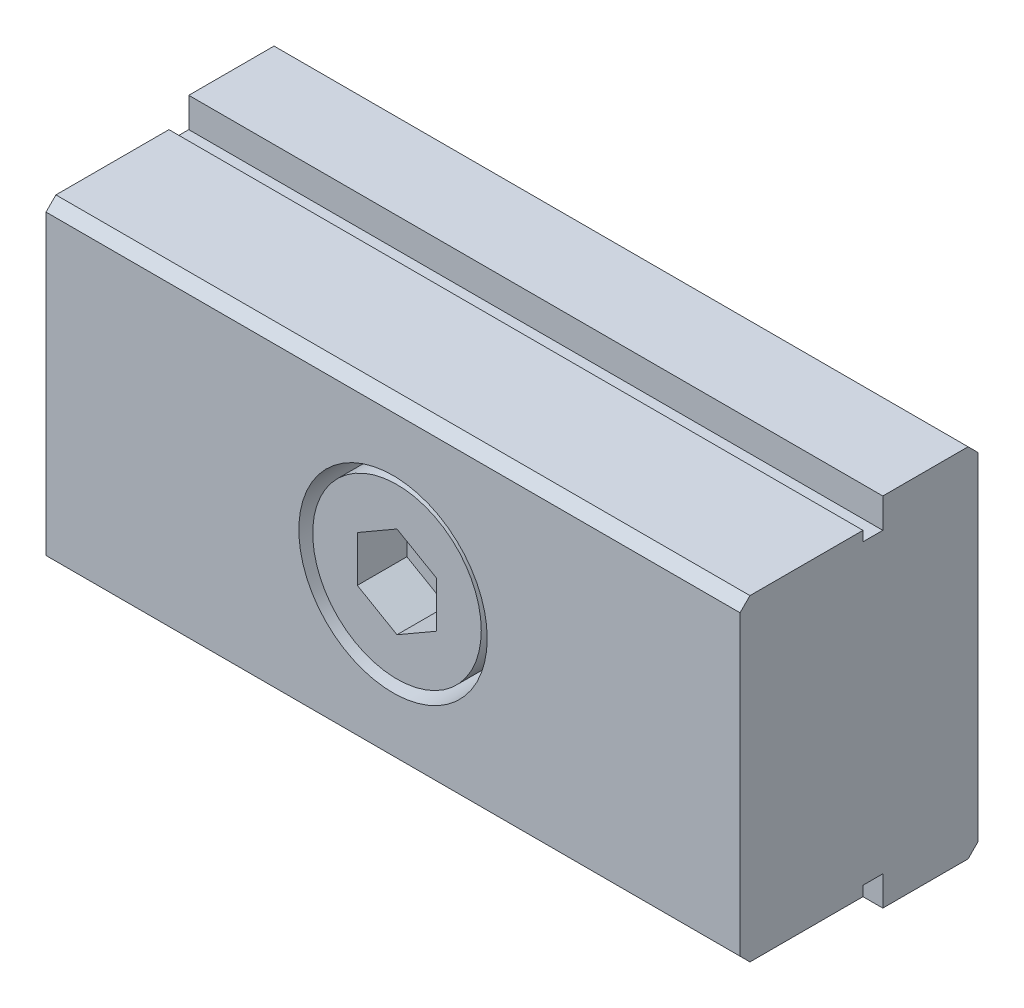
ISO-10303-21;
HEADER;
FILE_DESCRIPTION(('STEP AP214'),'2;1');
FILE_NAME('part.step','',(''),(''),'','','');
FILE_SCHEMA(('AUTOMOTIVE_DESIGN { 1 0 10303 214 1 1 1 1 }'));
ENDSEC;
DATA;
#1=APPLICATION_CONTEXT('core data for automotive mechanical design processes');
#2=APPLICATION_PROTOCOL_DEFINITION('international standard','automotive_design',2000,#1);
#3=PRODUCT_CONTEXT('',#1,'mechanical');
#4=PRODUCT('Part','Part','',(#3));
#5=PRODUCT_RELATED_PRODUCT_CATEGORY('part','',(#4));
#6=PRODUCT_DEFINITION_FORMATION('','',#4);
#7=PRODUCT_DEFINITION_CONTEXT('part definition',#1,'design');
#8=PRODUCT_DEFINITION('design','',#6,#7);
#9=PRODUCT_DEFINITION_SHAPE('','',#8);
#10=(LENGTH_UNIT() NAMED_UNIT(*) SI_UNIT(.MILLI.,.METRE.));
#11=(NAMED_UNIT(*) PLANE_ANGLE_UNIT() SI_UNIT($,.RADIAN.));
#12=(NAMED_UNIT(*) SI_UNIT($,.STERADIAN.) SOLID_ANGLE_UNIT());
#13=UNCERTAINTY_MEASURE_WITH_UNIT(LENGTH_MEASURE(1.E-05),#10,'distance_accuracy_value','');
#14=(GEOMETRIC_REPRESENTATION_CONTEXT(3) GLOBAL_UNCERTAINTY_ASSIGNED_CONTEXT((#13)) GLOBAL_UNIT_ASSIGNED_CONTEXT((#10,
#11,#12)) REPRESENTATION_CONTEXT('',''));
#15=CARTESIAN_POINT('',(0.,0.,0.));
#16=DIRECTION('',(0.,0.,1.));
#17=DIRECTION('',(1.,0.,0.));
#18=AXIS2_PLACEMENT_3D('',#15,#16,#17);
#19=CARTESIAN_POINT('',(2.5,0.,-10.));
#20=DIRECTION('',(0.,0.,-1.));
#21=DIRECTION('',(-1.,0.,0.));
#22=AXIS2_PLACEMENT_3D('',#19,#20,#21);
#23=PLANE('',#22);
#24=CARTESIAN_POINT('',(0.,0.,-10.));
#25=DIRECTION('',(0.,0.,-1.));
#26=DIRECTION('',(-1.,0.,0.));
#27=AXIS2_PLACEMENT_3D('',#24,#25,#26);
#28=CIRCLE('',#27,1.6);
#29=CARTESIAN_POINT('',(-1.6,0.,-10.));
#30=VERTEX_POINT('',#29);
#31=EDGE_CURVE('E24',#30,#30,#28,.T.);
#32=ORIENTED_EDGE('',*,*,#31,.T.);
#33=EDGE_LOOP('',(#32));
#34=FACE_BOUND('',#33,.T.);
#35=ADVANCED_FACE('F14',(#34),#23,.T.);
#36=CARTESIAN_POINT('',(0.,0.,-9.1));
#37=DIRECTION('',(0.,0.,1.));
#38=DIRECTION('',(1.,0.,0.));
#39=AXIS2_PLACEMENT_3D('',#36,#37,#38);
#40=CONICAL_SURFACE('',#39,2.5,0.785398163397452);
#41=ORIENTED_EDGE('',*,*,#31,.F.);
#42=EDGE_LOOP('',(#41));
#43=FACE_BOUND('',#42,.T.);
#44=CARTESIAN_POINT('',(0.,0.,-9.1));
#45=DIRECTION('',(0.,0.,-1.));
#46=DIRECTION('',(-1.,0.,0.));
#47=AXIS2_PLACEMENT_3D('',#44,#45,#46);
#48=CIRCLE('',#47,2.5);
#49=CARTESIAN_POINT('',(-2.5,0.,-9.1));
#50=VERTEX_POINT('',#49);
#51=EDGE_CURVE('E224',#50,#50,#48,.F.);
#52=ORIENTED_EDGE('',*,*,#51,.F.);
#53=EDGE_LOOP('',(#52));
#54=FACE_BOUND('',#53,.T.);
#55=ADVANCED_FACE('F397',(#43,#54),#40,.T.);
#56=CARTESIAN_POINT('',(0.,0.,10.));
#57=DIRECTION('',(0.,0.,1.));
#58=DIRECTION('',(1.,0.,0.));
#59=AXIS2_PLACEMENT_3D('',#56,#57,#58);
#60=CYLINDRICAL_SURFACE('',#59,2.5);
#61=ORIENTED_EDGE('',*,*,#51,.T.);
#62=EDGE_LOOP('',(#61));
#63=FACE_BOUND('',#62,.T.);
#64=CARTESIAN_POINT('',(0.,0.,2.));
#65=DIRECTION('',(0.,0.,1.));
#66=DIRECTION('',(1.,0.,0.));
#67=AXIS2_PLACEMENT_3D('',#64,#65,#66);
#68=CIRCLE('',#67,2.5);
#69=CARTESIAN_POINT('',(2.5,0.,2.));
#70=VERTEX_POINT('',#69);
#71=EDGE_CURVE('E215',#70,#70,#68,.T.);
#72=ORIENTED_EDGE('',*,*,#71,.F.);
#73=EDGE_LOOP('',(#72));
#74=FACE_BOUND('',#73,.T.);
#75=ADVANCED_FACE('F386',(#63,#74),#60,.T.);
#76=CARTESIAN_POINT('',(4.25,0.,2.));
#77=DIRECTION('',(0.,0.,-1.));
#78=DIRECTION('',(-1.,0.,0.));
#79=AXIS2_PLACEMENT_3D('',#76,#77,#78);
#80=PLANE('',#79);
#81=ORIENTED_EDGE('',*,*,#71,.T.);
#82=EDGE_LOOP('',(#81));
#83=FACE_BOUND('',#82,.T.);
#84=CARTESIAN_POINT('',(0.,0.,2.));
#85=DIRECTION('',(0.,0.,-1.));
#86=DIRECTION('',(-1.,0.,0.));
#87=AXIS2_PLACEMENT_3D('',#84,#85,#86);
#88=CIRCLE('',#87,2.75);
#89=CARTESIAN_POINT('',(-2.75,0.,2.));
#90=VERTEX_POINT('',#89);
#91=EDGE_CURVE('E9',#90,#90,#88,.T.);
#92=ORIENTED_EDGE('',*,*,#91,.T.);
#93=EDGE_LOOP('',(#92));
#94=FACE_BOUND('',#93,.T.);
#95=ADVANCED_FACE('F376',(#83,#94),#80,.T.);
#96=CARTESIAN_POINT('',(0.,2.3094010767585,4.5));
#97=DIRECTION('',(-0.5,-0.86602540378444,0.));
#98=DIRECTION('',(0.86602540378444,-0.5,0.));
#99=AXIS2_PLACEMENT_3D('',#96,#97,#98);
#100=PLANE('',#99);
#101=DIRECTION('',(0.,0.,1.));
#102=VECTOR('',#101,1.);
#103=CARTESIAN_POINT('',(2.,1.15470053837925,4.5));
#104=LINE('',#103,#102);
#105=CARTESIAN_POINT('',(2.,1.15470053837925,4.5));
#106=VERTEX_POINT('',#105);
#107=CARTESIAN_POINT('',(2.,1.15470053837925,7.));
#108=VERTEX_POINT('',#107);
#109=EDGE_CURVE('E144',#106,#108,#104,.T.);
#110=ORIENTED_EDGE('',*,*,#109,.T.);
#111=DIRECTION('',(0.86602540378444,-0.5,0.));
#112=VECTOR('',#111,1.);
#113=CARTESIAN_POINT('',(0.,2.3094010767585,7.));
#114=LINE('',#113,#112);
#115=CARTESIAN_POINT('',(0.,2.3094010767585,7.));
#116=VERTEX_POINT('',#115);
#117=EDGE_CURVE('E33',#116,#108,#114,.T.);
#118=ORIENTED_EDGE('',*,*,#117,.F.);
#119=DIRECTION('',(0.,0.,1.));
#120=VECTOR('',#119,1.);
#121=CARTESIAN_POINT('',(0.,2.3094010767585,4.5));
#122=LINE('',#121,#120);
#123=CARTESIAN_POINT('',(0.,2.3094010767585,4.5));
#124=VERTEX_POINT('',#123);
#125=EDGE_CURVE('E183',#124,#116,#122,.T.);
#126=ORIENTED_EDGE('',*,*,#125,.F.);
#127=DIRECTION('',(0.86602540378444,-0.5,0.));
#128=VECTOR('',#127,1.);
#129=CARTESIAN_POINT('',(0.,2.3094010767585,4.5));
#130=LINE('',#129,#128);
#131=EDGE_CURVE('E196',#124,#106,#130,.T.);
#132=ORIENTED_EDGE('',*,*,#131,.T.);
#133=EDGE_LOOP('',(#110,#118,#126,#132));
#134=FACE_BOUND('',#133,.T.);
#135=ADVANCED_FACE('F374',(#134),#100,.T.);
#136=CARTESIAN_POINT('',(2.,-1.15470053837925,4.5));
#137=DIRECTION('',(1.,0.,0.));
#138=DIRECTION('',(0.,0.,-1.));
#139=AXIS2_PLACEMENT_3D('',#136,#137,#138);
#140=PLANE('',#139);
#141=DIRECTION('',(0.,0.,1.));
#142=VECTOR('',#141,1.);
#143=CARTESIAN_POINT('',(2.,-1.15470053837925,4.5));
#144=LINE('',#143,#142);
#145=CARTESIAN_POINT('',(2.,-1.15470053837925,4.5));
#146=VERTEX_POINT('',#145);
#147=CARTESIAN_POINT('',(2.,-1.15470053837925,7.));
#148=VERTEX_POINT('',#147);
#149=EDGE_CURVE('E212',#146,#148,#144,.T.);
#150=ORIENTED_EDGE('',*,*,#149,.T.);
#151=DIRECTION('',(0.,1.,0.));
#152=VECTOR('',#151,1.);
#153=CARTESIAN_POINT('',(2.,-1.15470053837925,7.));
#154=LINE('',#153,#152);
#155=EDGE_CURVE('E351',#148,#108,#154,.T.);
#156=ORIENTED_EDGE('',*,*,#155,.T.);
#157=ORIENTED_EDGE('',*,*,#109,.F.);
#158=DIRECTION('',(0.,1.,0.));
#159=VECTOR('',#158,1.);
#160=CARTESIAN_POINT('',(2.,-1.15470053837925,4.5));
#161=LINE('',#160,#159);
#162=EDGE_CURVE('E206',#146,#106,#161,.T.);
#163=ORIENTED_EDGE('',*,*,#162,.F.);
#164=EDGE_LOOP('',(#150,#156,#157,#163));
#165=FACE_BOUND('',#164,.T.);
#166=ADVANCED_FACE('F373',(#165),#140,.F.);
#167=CARTESIAN_POINT('',(0.,-2.3094010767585,4.5));
#168=DIRECTION('',(0.5,-0.86602540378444,0.));
#169=DIRECTION('',(0.86602540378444,0.5,0.));
#170=AXIS2_PLACEMENT_3D('',#167,#168,#169);
#171=PLANE('',#170);
#172=DIRECTION('',(0.,0.,1.));
#173=VECTOR('',#172,1.);
#174=CARTESIAN_POINT('',(0.,-2.3094010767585,4.5));
#175=LINE('',#174,#173);
#176=CARTESIAN_POINT('',(0.,-2.3094010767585,4.5));
#177=VERTEX_POINT('',#176);
#178=CARTESIAN_POINT('',(0.,-2.3094010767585,7.));
#179=VERTEX_POINT('',#178);
#180=EDGE_CURVE('E210',#177,#179,#175,.T.);
#181=ORIENTED_EDGE('',*,*,#180,.T.);
#182=DIRECTION('',(0.86602540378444,0.5,0.));
#183=VECTOR('',#182,1.);
#184=CARTESIAN_POINT('',(0.,-2.3094010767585,7.));
#185=LINE('',#184,#183);
#186=EDGE_CURVE('E354',#179,#148,#185,.T.);
#187=ORIENTED_EDGE('',*,*,#186,.T.);
#188=ORIENTED_EDGE('',*,*,#149,.F.);
#189=DIRECTION('',(0.86602540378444,0.5,0.));
#190=VECTOR('',#189,1.);
#191=CARTESIAN_POINT('',(0.,-2.3094010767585,4.5));
#192=LINE('',#191,#190);
#193=EDGE_CURVE('E203',#177,#146,#192,.T.);
#194=ORIENTED_EDGE('',*,*,#193,.F.);
#195=EDGE_LOOP('',(#181,#187,#188,#194));
#196=FACE_BOUND('',#195,.T.);
#197=ADVANCED_FACE('F372',(#196),#171,.F.);
#198=CARTESIAN_POINT('',(0.,-2.3094010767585,4.5));
#199=DIRECTION('',(0.5,0.86602540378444,0.));
#200=DIRECTION('',(-0.86602540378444,0.5,0.));
#201=AXIS2_PLACEMENT_3D('',#198,#199,#200);
#202=PLANE('',#201);
#203=DIRECTION('',(0.,0.,1.));
#204=VECTOR('',#203,1.);
#205=CARTESIAN_POINT('',(-2.,-1.15470053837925,4.5));
#206=LINE('',#205,#204);
#207=CARTESIAN_POINT('',(-2.,-1.15470053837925,4.5));
#208=VERTEX_POINT('',#207);
#209=CARTESIAN_POINT('',(-2.,-1.15470053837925,7.));
#210=VERTEX_POINT('',#209);
#211=EDGE_CURVE('E182',#208,#210,#206,.T.);
#212=ORIENTED_EDGE('',*,*,#211,.T.);
#213=DIRECTION('',(-0.86602540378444,0.5,0.));
#214=VECTOR('',#213,1.);
#215=CARTESIAN_POINT('',(0.,-2.3094010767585,7.));
#216=LINE('',#215,#214);
#217=EDGE_CURVE('E357',#179,#210,#216,.T.);
#218=ORIENTED_EDGE('',*,*,#217,.F.);
#219=ORIENTED_EDGE('',*,*,#180,.F.);
#220=DIRECTION('',(-0.86602540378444,0.5,0.));
#221=VECTOR('',#220,1.);
#222=CARTESIAN_POINT('',(0.,-2.3094010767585,4.5));
#223=LINE('',#222,#221);
#224=EDGE_CURVE('E191',#177,#208,#223,.T.);
#225=ORIENTED_EDGE('',*,*,#224,.T.);
#226=EDGE_LOOP('',(#212,#218,#219,#225));
#227=FACE_BOUND('',#226,.T.);
#228=ADVANCED_FACE('F368',(#227),#202,.T.);
#229=CARTESIAN_POINT('',(-2.,1.15470053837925,4.5));
#230=DIRECTION('',(-1.,0.,0.));
#231=DIRECTION('',(0.,-1.,0.));
#232=AXIS2_PLACEMENT_3D('',#229,#230,#231);
#233=PLANE('',#232);
#234=DIRECTION('',(0.,0.,1.));
#235=VECTOR('',#234,1.);
#236=CARTESIAN_POINT('',(-2.,1.15470053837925,4.5));
#237=LINE('',#236,#235);
#238=CARTESIAN_POINT('',(-2.,1.15470053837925,4.5));
#239=VERTEX_POINT('',#238);
#240=CARTESIAN_POINT('',(-2.,1.15470053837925,7.));
#241=VERTEX_POINT('',#240);
#242=EDGE_CURVE('E172',#239,#241,#237,.T.);
#243=ORIENTED_EDGE('',*,*,#242,.T.);
#244=DIRECTION('',(0.,-1.,0.));
#245=VECTOR('',#244,1.);
#246=CARTESIAN_POINT('',(-2.,1.15470053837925,7.));
#247=LINE('',#246,#245);
#248=EDGE_CURVE('E362',#241,#210,#247,.T.);
#249=ORIENTED_EDGE('',*,*,#248,.T.);
#250=ORIENTED_EDGE('',*,*,#211,.F.);
#251=DIRECTION('',(0.,-1.,0.));
#252=VECTOR('',#251,1.);
#253=CARTESIAN_POINT('',(-2.,1.15470053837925,4.5));
#254=LINE('',#253,#252);
#255=EDGE_CURVE('E186',#239,#208,#254,.T.);
#256=ORIENTED_EDGE('',*,*,#255,.F.);
#257=EDGE_LOOP('',(#243,#249,#250,#256));
#258=FACE_BOUND('',#257,.T.);
#259=ADVANCED_FACE('F187',(#258),#233,.F.);
#260=CARTESIAN_POINT('',(0.,2.3094010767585,4.5));
#261=DIRECTION('',(-0.5,0.86602540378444,0.));
#262=DIRECTION('',(-0.86602540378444,-0.5,0.));
#263=AXIS2_PLACEMENT_3D('',#260,#261,#262);
#264=PLANE('',#263);
#265=DIRECTION('',(-0.86602540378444,-0.5,0.));
#266=VECTOR('',#265,1.);
#267=CARTESIAN_POINT('',(0.,2.3094010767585,4.5));
#268=LINE('',#267,#266);
#269=EDGE_CURVE('E176',#124,#239,#268,.T.);
#270=ORIENTED_EDGE('',*,*,#269,.F.);
#271=ORIENTED_EDGE('',*,*,#125,.T.);
#272=DIRECTION('',(-0.86602540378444,-0.5,0.));
#273=VECTOR('',#272,1.);
#274=CARTESIAN_POINT('',(0.,2.3094010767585,7.));
#275=LINE('',#274,#273);
#276=EDGE_CURVE('E178',#116,#241,#275,.T.);
#277=ORIENTED_EDGE('',*,*,#276,.T.);
#278=ORIENTED_EDGE('',*,*,#242,.F.);
#279=EDGE_LOOP('',(#270,#271,#277,#278));
#280=FACE_BOUND('',#279,.T.);
#281=ADVANCED_FACE('F174',(#280),#264,.F.);
#282=CARTESIAN_POINT('',(-2.,3.46410161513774,4.5));
#283=DIRECTION('',(0.,0.,-1.));
#284=DIRECTION('',(-1.,0.,0.));
#285=AXIS2_PLACEMENT_3D('',#282,#283,#284);
#286=PLANE('',#285);
#287=ORIENTED_EDGE('',*,*,#131,.F.);
#288=ORIENTED_EDGE('',*,*,#269,.T.);
#289=ORIENTED_EDGE('',*,*,#255,.T.);
#290=ORIENTED_EDGE('',*,*,#224,.F.);
#291=ORIENTED_EDGE('',*,*,#193,.T.);
#292=ORIENTED_EDGE('',*,*,#162,.T.);
#293=EDGE_LOOP('',(#287,#288,#289,#290,#291,#292));
#294=FACE_BOUND('',#293,.T.);
#295=ADVANCED_FACE('F194',(#294),#286,.F.);
#296=CARTESIAN_POINT('',(0.,0.,7.));
#297=DIRECTION('',(0.,0.,1.));
#298=DIRECTION('',(1.,0.,0.));
#299=AXIS2_PLACEMENT_3D('',#296,#297,#298);
#300=PLANE('',#299);
#301=CARTESIAN_POINT('',(0.,0.,7.));
#302=DIRECTION('',(0.,0.,1.));
#303=DIRECTION('',(1.,0.,0.));
#304=AXIS2_PLACEMENT_3D('',#301,#302,#303);
#305=CIRCLE('',#304,4.25);
#306=CARTESIAN_POINT('',(4.25,0.,7.));
#307=VERTEX_POINT('',#306);
#308=EDGE_CURVE('E221',#307,#307,#305,.T.);
#309=ORIENTED_EDGE('',*,*,#308,.T.);
#310=EDGE_LOOP('',(#309));
#311=FACE_BOUND('',#310,.T.);
#312=ORIENTED_EDGE('',*,*,#276,.F.);
#313=ORIENTED_EDGE('',*,*,#117,.T.);
#314=ORIENTED_EDGE('',*,*,#155,.F.);
#315=ORIENTED_EDGE('',*,*,#186,.F.);
#316=ORIENTED_EDGE('',*,*,#217,.T.);
#317=ORIENTED_EDGE('',*,*,#248,.F.);
#318=EDGE_LOOP('',(#312,#313,#314,#315,#316,#317));
#319=FACE_BOUND('',#318,.T.);
#320=ADVANCED_FACE('F366',(#311,#319),#300,.T.);
#321=CARTESIAN_POINT('',(0.,0.,10.));
#322=DIRECTION('',(0.,0.,1.));
#323=DIRECTION('',(1.,0.,0.));
#324=AXIS2_PLACEMENT_3D('',#321,#322,#323);
#325=CYLINDRICAL_SURFACE('',#324,4.25);
#326=CARTESIAN_POINT('',(0.,0.,2.));
#327=DIRECTION('',(0.,0.,1.));
#328=DIRECTION('',(1.,0.,0.));
#329=AXIS2_PLACEMENT_3D('',#326,#327,#328);
#330=CIRCLE('',#329,4.25);
#331=CARTESIAN_POINT('',(4.25,0.,2.));
#332=VERTEX_POINT('',#331);
#333=EDGE_CURVE('E218',#332,#332,#330,.T.);
#334=ORIENTED_EDGE('',*,*,#333,.T.);
#335=EDGE_LOOP('',(#334));
#336=FACE_BOUND('',#335,.T.);
#337=ORIENTED_EDGE('',*,*,#308,.F.);
#338=EDGE_LOOP('',(#337));
#339=FACE_BOUND('',#338,.T.);
#340=ADVANCED_FACE('F411',(#336,#339),#325,.T.);
#341=CARTESIAN_POINT('',(-17.5,-9.,0.));
#342=DIRECTION('',(0.,1.,0.));
#343=DIRECTION('',(-1.,0.,0.));
#344=AXIS2_PLACEMENT_3D('',#341,#342,#343);
#345=PLANE('',#344);
#346=DIRECTION('',(0.,0.,1.));
#347=VECTOR('',#346,1.);
#348=CARTESIAN_POINT('',(17.5,-9.,0.));
#349=LINE('',#348,#347);
#350=CARTESIAN_POINT('',(17.5,-9.,-4.3));
#351=VERTEX_POINT('',#350);
#352=CARTESIAN_POINT('',(17.5,-9.,0.));
#353=VERTEX_POINT('',#352);
#354=EDGE_CURVE('E241',#351,#353,#349,.T.);
#355=ORIENTED_EDGE('',*,*,#354,.T.);
#356=DIRECTION('',(1.,0.,0.));
#357=VECTOR('',#356,1.);
#358=CARTESIAN_POINT('',(-17.5,-9.,0.));
#359=LINE('',#358,#357);
#360=CARTESIAN_POINT('',(-17.5,-9.,0.));
#361=VERTEX_POINT('',#360);
#362=EDGE_CURVE('E342',#361,#353,#359,.T.);
#363=ORIENTED_EDGE('',*,*,#362,.F.);
#364=DIRECTION('',(0.,0.,1.));
#365=VECTOR('',#364,1.);
#366=CARTESIAN_POINT('',(-17.5,-9.,0.));
#367=LINE('',#366,#365);
#368=CARTESIAN_POINT('',(-17.5,-9.,-4.3));
#369=VERTEX_POINT('',#368);
#370=EDGE_CURVE('E273',#369,#361,#367,.T.);
#371=ORIENTED_EDGE('',*,*,#370,.F.);
#372=DIRECTION('',(1.,0.,0.));
#373=VECTOR('',#372,1.);
#374=CARTESIAN_POINT('',(-17.5,-9.,-4.3));
#375=LINE('',#374,#373);
#376=EDGE_CURVE('E18',#369,#351,#375,.T.);
#377=ORIENTED_EDGE('',*,*,#376,.T.);
#378=EDGE_LOOP('',(#355,#363,#371,#377));
#379=FACE_BOUND('',#378,.T.);
#380=ADVANCED_FACE('F414',(#379),#345,.F.);
#381=CARTESIAN_POINT('',(-17.5,-7.5,0.));
#382=DIRECTION('',(0.,0.,-1.));
#383=DIRECTION('',(1.,0.,0.));
#384=AXIS2_PLACEMENT_3D('',#381,#382,#383);
#385=PLANE('',#384);
#386=DIRECTION('',(0.,1.,0.));
#387=VECTOR('',#386,1.);
#388=CARTESIAN_POINT('',(17.5,-7.5,0.));
#389=LINE('',#388,#387);
#390=CARTESIAN_POINT('',(17.5,-7.5,0.));
#391=VERTEX_POINT('',#390);
#392=EDGE_CURVE('E243',#353,#391,#389,.T.);
#393=ORIENTED_EDGE('',*,*,#392,.T.);
#394=DIRECTION('',(1.,0.,0.));
#395=VECTOR('',#394,1.);
#396=CARTESIAN_POINT('',(-17.5,-7.5,0.));
#397=LINE('',#396,#395);
#398=CARTESIAN_POINT('',(-17.5,-7.5,0.));
#399=VERTEX_POINT('',#398);
#400=EDGE_CURVE('E340',#399,#391,#397,.T.);
#401=ORIENTED_EDGE('',*,*,#400,.F.);
#402=DIRECTION('',(0.,1.,0.));
#403=VECTOR('',#402,1.);
#404=CARTESIAN_POINT('',(-17.5,-7.5,0.));
#405=LINE('',#404,#403);
#406=EDGE_CURVE('E275',#361,#399,#405,.T.);
#407=ORIENTED_EDGE('',*,*,#406,.F.);
#408=ORIENTED_EDGE('',*,*,#362,.T.);
#409=EDGE_LOOP('',(#393,#401,#407,#408));
#410=FACE_BOUND('',#409,.T.);
#411=ADVANCED_FACE('F483',(#410),#385,.F.);
#412=CARTESIAN_POINT('',(-17.5,-7.5,1.));
#413=DIRECTION('',(0.,1.,0.));
#414=DIRECTION('',(-1.,0.,0.));
#415=AXIS2_PLACEMENT_3D('',#412,#413,#414);
#416=PLANE('',#415);
#417=DIRECTION('',(0.,0.,1.));
#418=VECTOR('',#417,1.);
#419=CARTESIAN_POINT('',(17.5,-7.5,1.));
#420=LINE('',#419,#418);
#421=CARTESIAN_POINT('',(17.5,-7.5,1.));
#422=VERTEX_POINT('',#421);
#423=EDGE_CURVE('E245',#391,#422,#420,.T.);
#424=ORIENTED_EDGE('',*,*,#423,.T.);
#425=DIRECTION('',(1.,0.,0.));
#426=VECTOR('',#425,1.);
#427=CARTESIAN_POINT('',(-17.5,-7.5,1.));
#428=LINE('',#427,#426);
#429=CARTESIAN_POINT('',(-17.5,-7.5,1.));
#430=VERTEX_POINT('',#429);
#431=EDGE_CURVE('E337',#430,#422,#428,.T.);
#432=ORIENTED_EDGE('',*,*,#431,.F.);
#433=DIRECTION('',(0.,0.,1.));
#434=VECTOR('',#433,1.);
#435=CARTESIAN_POINT('',(-17.5,-7.5,1.));
#436=LINE('',#435,#434);
#437=EDGE_CURVE('E277',#399,#430,#436,.T.);
#438=ORIENTED_EDGE('',*,*,#437,.F.);
#439=ORIENTED_EDGE('',*,*,#400,.T.);
#440=EDGE_LOOP('',(#424,#432,#438,#439));
#441=FACE_BOUND('',#440,.T.);
#442=ADVANCED_FACE('F479',(#441),#416,.F.);
#443=CARTESIAN_POINT('',(-17.5,-8.,1.));
#444=DIRECTION('',(0.,0.,1.));
#445=DIRECTION('',(-1.,0.,0.));
#446=AXIS2_PLACEMENT_3D('',#443,#444,#445);
#447=PLANE('',#446);
#448=DIRECTION('',(0.,-1.,0.));
#449=VECTOR('',#448,1.);
#450=CARTESIAN_POINT('',(17.5,-8.,1.));
#451=LINE('',#450,#449);
#452=CARTESIAN_POINT('',(17.5,-8.,1.));
#453=VERTEX_POINT('',#452);
#454=EDGE_CURVE('E247',#422,#453,#451,.T.);
#455=ORIENTED_EDGE('',*,*,#454,.T.);
#456=DIRECTION('',(1.,0.,0.));
#457=VECTOR('',#456,1.);
#458=CARTESIAN_POINT('',(-17.5,-8.,1.));
#459=LINE('',#458,#457);
#460=CARTESIAN_POINT('',(-17.5,-8.,1.));
#461=VERTEX_POINT('',#460);
#462=EDGE_CURVE('E334',#461,#453,#459,.T.);
#463=ORIENTED_EDGE('',*,*,#462,.F.);
#464=DIRECTION('',(0.,-1.,0.));
#465=VECTOR('',#464,1.);
#466=CARTESIAN_POINT('',(-17.5,-8.,1.));
#467=LINE('',#466,#465);
#468=EDGE_CURVE('E279',#430,#461,#467,.T.);
#469=ORIENTED_EDGE('',*,*,#468,.F.);
#470=ORIENTED_EDGE('',*,*,#431,.T.);
#471=EDGE_LOOP('',(#455,#463,#469,#470));
#472=FACE_BOUND('',#471,.T.);
#473=ADVANCED_FACE('F475',(#472),#447,.F.);
#474=CARTESIAN_POINT('',(-17.5,-8.,6.7));
#475=DIRECTION('',(0.,1.,0.));
#476=DIRECTION('',(-1.,0.,0.));
#477=AXIS2_PLACEMENT_3D('',#474,#475,#476);
#478=PLANE('',#477);
#479=DIRECTION('',(0.,0.,1.));
#480=VECTOR('',#479,1.);
#481=CARTESIAN_POINT('',(17.5,-8.,6.7));
#482=LINE('',#481,#480);
#483=CARTESIAN_POINT('',(17.5,-8.,6.7));
#484=VERTEX_POINT('',#483);
#485=EDGE_CURVE('E249',#453,#484,#482,.T.);
#486=ORIENTED_EDGE('',*,*,#485,.T.);
#487=DIRECTION('',(1.,0.,0.));
#488=VECTOR('',#487,1.);
#489=CARTESIAN_POINT('',(-17.5,-8.,6.7));
#490=LINE('',#489,#488);
#491=CARTESIAN_POINT('',(-17.5,-8.,6.7));
#492=VERTEX_POINT('',#491);
#493=EDGE_CURVE('E331',#492,#484,#490,.T.);
#494=ORIENTED_EDGE('',*,*,#493,.F.);
#495=DIRECTION('',(0.,0.,1.));
#496=VECTOR('',#495,1.);
#497=CARTESIAN_POINT('',(-17.5,-8.,6.7));
#498=LINE('',#497,#496);
#499=EDGE_CURVE('E281',#461,#492,#498,.T.);
#500=ORIENTED_EDGE('',*,*,#499,.F.);
#501=ORIENTED_EDGE('',*,*,#462,.T.);
#502=EDGE_LOOP('',(#486,#494,#500,#501));
#503=FACE_BOUND('',#502,.T.);
#504=ADVANCED_FACE('F471',(#503),#478,.F.);
#505=CARTESIAN_POINT('',(-17.5,-7.5,7.2));
#506=DIRECTION('',(0.,0.707106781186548,-0.707106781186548));
#507=DIRECTION('',(0.,-0.707106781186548,-0.707106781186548));
#508=AXIS2_PLACEMENT_3D('',#505,#506,#507);
#509=PLANE('',#508);
#510=DIRECTION('',(0.,0.707106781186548,0.707106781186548));
#511=VECTOR('',#510,1.);
#512=CARTESIAN_POINT('',(17.5,-7.5,7.2));
#513=LINE('',#512,#511);
#514=CARTESIAN_POINT('',(17.5,-7.5,7.2));
#515=VERTEX_POINT('',#514);
#516=EDGE_CURVE('E251',#484,#515,#513,.T.);
#517=ORIENTED_EDGE('',*,*,#516,.T.);
#518=DIRECTION('',(1.,0.,0.));
#519=VECTOR('',#518,1.);
#520=CARTESIAN_POINT('',(-17.5,-7.5,7.2));
#521=LINE('',#520,#519);
#522=CARTESIAN_POINT('',(-17.5,-7.5,7.2));
#523=VERTEX_POINT('',#522);
#524=EDGE_CURVE('E328',#523,#515,#521,.T.);
#525=ORIENTED_EDGE('',*,*,#524,.F.);
#526=DIRECTION('',(0.,0.707106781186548,0.707106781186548));
#527=VECTOR('',#526,1.);
#528=CARTESIAN_POINT('',(-17.5,-7.5,7.2));
#529=LINE('',#528,#527);
#530=EDGE_CURVE('E283',#492,#523,#529,.T.);
#531=ORIENTED_EDGE('',*,*,#530,.F.);
#532=ORIENTED_EDGE('',*,*,#493,.T.);
#533=EDGE_LOOP('',(#517,#525,#531,#532));
#534=FACE_BOUND('',#533,.T.);
#535=ADVANCED_FACE('F467',(#534),#509,.F.);
#536=CARTESIAN_POINT('',(-17.5,-7.5,7.2));
#537=DIRECTION('',(0.,0.,-1.));
#538=DIRECTION('',(1.,0.,0.));
#539=AXIS2_PLACEMENT_3D('',#536,#537,#538);
#540=PLANE('',#539);
#541=CARTESIAN_POINT('',(0.,0.,7.2));
#542=DIRECTION('',(0.,0.,-1.));
#543=DIRECTION('',(1.,0.,0.));
#544=AXIS2_PLACEMENT_3D('',#541,#542,#543);
#545=CIRCLE('',#544,4.75);
#546=CARTESIAN_POINT('',(4.75,0.,7.2));
#547=VERTEX_POINT('',#546);
#548=EDGE_CURVE('E229',#547,#547,#545,.T.);
#549=ORIENTED_EDGE('',*,*,#548,.T.);
#550=EDGE_LOOP('',(#549));
#551=FACE_BOUND('',#550,.T.);
#552=DIRECTION('',(0.,1.,0.));
#553=VECTOR('',#552,1.);
#554=CARTESIAN_POINT('',(17.5,-7.5,7.2));
#555=LINE('',#554,#553);
#556=CARTESIAN_POINT('',(17.5,7.5,7.2));
#557=VERTEX_POINT('',#556);
#558=EDGE_CURVE('E253',#515,#557,#555,.T.);
#559=ORIENTED_EDGE('',*,*,#558,.T.);
#560=DIRECTION('',(1.,0.,0.));
#561=VECTOR('',#560,1.);
#562=CARTESIAN_POINT('',(-17.5,7.5,7.2));
#563=LINE('',#562,#561);
#564=CARTESIAN_POINT('',(-17.5,7.5,7.2));
#565=VERTEX_POINT('',#564);
#566=EDGE_CURVE('E325',#565,#557,#563,.T.);
#567=ORIENTED_EDGE('',*,*,#566,.F.);
#568=DIRECTION('',(0.,1.,0.));
#569=VECTOR('',#568,1.);
#570=CARTESIAN_POINT('',(-17.5,-7.5,7.2));
#571=LINE('',#570,#569);
#572=EDGE_CURVE('E285',#523,#565,#571,.T.);
#573=ORIENTED_EDGE('',*,*,#572,.F.);
#574=ORIENTED_EDGE('',*,*,#524,.T.);
#575=EDGE_LOOP('',(#559,#567,#573,#574));
#576=FACE_BOUND('',#575,.T.);
#577=ADVANCED_FACE('F393',(#551,#576),#540,.F.);
#578=CARTESIAN_POINT('',(0.,0.,-4.8));
#579=DIRECTION('',(0.,0.,-1.));
#580=DIRECTION('',(1.,0.,0.));
#581=AXIS2_PLACEMENT_3D('',#578,#579,#580);
#582=CYLINDRICAL_SURFACE('',#581,4.75);
#583=ORIENTED_EDGE('',*,*,#548,.F.);
#584=EDGE_LOOP('',(#583));
#585=FACE_BOUND('',#584,.T.);
#586=CARTESIAN_POINT('',(0.,0.,2.));
#587=DIRECTION('',(0.,0.,-1.));
#588=DIRECTION('',(1.,0.,0.));
#589=AXIS2_PLACEMENT_3D('',#586,#587,#588);
#590=CIRCLE('',#589,4.75);
#591=CARTESIAN_POINT('',(4.75,0.,2.));
#592=VERTEX_POINT('',#591);
#593=EDGE_CURVE('E232',#592,#592,#590,.T.);
#594=ORIENTED_EDGE('',*,*,#593,.T.);
#595=EDGE_LOOP('',(#594));
#596=FACE_BOUND('',#595,.T.);
#597=ADVANCED_FACE('F378',(#585,#596),#582,.F.);
#598=CARTESIAN_POINT('',(0.,-4.75,2.));
#599=DIRECTION('',(0.,0.,-1.));
#600=DIRECTION('',(1.,0.,0.));
#601=AXIS2_PLACEMENT_3D('',#598,#599,#600);
#602=PLANE('',#601);
#603=ORIENTED_EDGE('',*,*,#333,.F.);
#604=EDGE_LOOP('',(#603));
#605=FACE_BOUND('',#604,.T.);
#606=ORIENTED_EDGE('',*,*,#593,.F.);
#607=EDGE_LOOP('',(#606));
#608=FACE_BOUND('',#607,.T.);
#609=ADVANCED_FACE('F392',(#605,#608),#602,.F.);
#610=CARTESIAN_POINT('',(-17.5,7.5,7.2));
#611=DIRECTION('',(0.,-0.707106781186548,-0.707106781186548));
#612=DIRECTION('',(0.,-0.707106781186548,0.707106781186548));
#613=AXIS2_PLACEMENT_3D('',#610,#611,#612);
#614=PLANE('',#613);
#615=DIRECTION('',(0.,0.707106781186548,-0.707106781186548));
#616=VECTOR('',#615,1.);
#617=CARTESIAN_POINT('',(17.5,7.5,7.2));
#618=LINE('',#617,#616);
#619=CARTESIAN_POINT('',(17.5,8.,6.7));
#620=VERTEX_POINT('',#619);
#621=EDGE_CURVE('E255',#557,#620,#618,.T.);
#622=ORIENTED_EDGE('',*,*,#621,.T.);
#623=DIRECTION('',(1.,0.,0.));
#624=VECTOR('',#623,1.);
#625=CARTESIAN_POINT('',(-17.5,8.,6.7));
#626=LINE('',#625,#624);
#627=CARTESIAN_POINT('',(-17.5,8.,6.7));
#628=VERTEX_POINT('',#627);
#629=EDGE_CURVE('E322',#628,#620,#626,.T.);
#630=ORIENTED_EDGE('',*,*,#629,.F.);
#631=DIRECTION('',(0.,0.707106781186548,-0.707106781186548));
#632=VECTOR('',#631,1.);
#633=CARTESIAN_POINT('',(-17.5,7.5,7.2));
#634=LINE('',#633,#632);
#635=EDGE_CURVE('E287',#565,#628,#634,.T.);
#636=ORIENTED_EDGE('',*,*,#635,.F.);
#637=ORIENTED_EDGE('',*,*,#566,.T.);
#638=EDGE_LOOP('',(#622,#630,#636,#637));
#639=FACE_BOUND('',#638,.T.);
#640=ADVANCED_FACE('F421',(#639),#614,.F.);
#641=CARTESIAN_POINT('',(-17.5,8.,6.7));
#642=DIRECTION('',(0.,-1.,0.));
#643=DIRECTION('',(1.,0.,0.));
#644=AXIS2_PLACEMENT_3D('',#641,#642,#643);
#645=PLANE('',#644);
#646=DIRECTION('',(0.,0.,-1.));
#647=VECTOR('',#646,1.);
#648=CARTESIAN_POINT('',(17.5,8.,6.7));
#649=LINE('',#648,#647);
#650=CARTESIAN_POINT('',(17.5,8.,1.));
#651=VERTEX_POINT('',#650);
#652=EDGE_CURVE('E257',#620,#651,#649,.T.);
#653=ORIENTED_EDGE('',*,*,#652,.T.);
#654=DIRECTION('',(1.,0.,0.));
#655=VECTOR('',#654,1.);
#656=CARTESIAN_POINT('',(-17.5,8.,1.));
#657=LINE('',#656,#655);
#658=CARTESIAN_POINT('',(-17.5,8.,1.));
#659=VERTEX_POINT('',#658);
#660=EDGE_CURVE('E319',#659,#651,#657,.T.);
#661=ORIENTED_EDGE('',*,*,#660,.F.);
#662=DIRECTION('',(0.,0.,-1.));
#663=VECTOR('',#662,1.);
#664=CARTESIAN_POINT('',(-17.5,8.,6.7));
#665=LINE('',#664,#663);
#666=EDGE_CURVE('E289',#628,#659,#665,.T.);
#667=ORIENTED_EDGE('',*,*,#666,.F.);
#668=ORIENTED_EDGE('',*,*,#629,.T.);
#669=EDGE_LOOP('',(#653,#661,#667,#668));
#670=FACE_BOUND('',#669,.T.);
#671=ADVANCED_FACE('F457',(#670),#645,.F.);
#672=CARTESIAN_POINT('',(-17.5,8.,1.));
#673=DIRECTION('',(0.,0.,1.));
#674=DIRECTION('',(-1.,0.,0.));
#675=AXIS2_PLACEMENT_3D('',#672,#673,#674);
#676=PLANE('',#675);
#677=DIRECTION('',(0.,-1.,0.));
#678=VECTOR('',#677,1.);
#679=CARTESIAN_POINT('',(17.5,8.,1.));
#680=LINE('',#679,#678);
#681=CARTESIAN_POINT('',(17.5,7.5,1.));
#682=VERTEX_POINT('',#681);
#683=EDGE_CURVE('E259',#651,#682,#680,.T.);
#684=ORIENTED_EDGE('',*,*,#683,.T.);
#685=DIRECTION('',(1.,0.,0.));
#686=VECTOR('',#685,1.);
#687=CARTESIAN_POINT('',(-17.5,7.5,1.));
#688=LINE('',#687,#686);
#689=CARTESIAN_POINT('',(-17.5,7.5,1.));
#690=VERTEX_POINT('',#689);
#691=EDGE_CURVE('E316',#690,#682,#688,.T.);
#692=ORIENTED_EDGE('',*,*,#691,.F.);
#693=DIRECTION('',(0.,-1.,0.));
#694=VECTOR('',#693,1.);
#695=CARTESIAN_POINT('',(-17.5,8.,1.));
#696=LINE('',#695,#694);
#697=EDGE_CURVE('E291',#659,#690,#696,.T.);
#698=ORIENTED_EDGE('',*,*,#697,.F.);
#699=ORIENTED_EDGE('',*,*,#660,.T.);
#700=EDGE_LOOP('',(#684,#692,#698,#699));
#701=FACE_BOUND('',#700,.T.);
#702=ADVANCED_FACE('F453',(#701),#676,.F.);
#703=CARTESIAN_POINT('',(-17.5,7.5,1.));
#704=DIRECTION('',(0.,-1.,0.));
#705=DIRECTION('',(1.,0.,0.));
#706=AXIS2_PLACEMENT_3D('',#703,#704,#705);
#707=PLANE('',#706);
#708=DIRECTION('',(0.,0.,-1.));
#709=VECTOR('',#708,1.);
#710=CARTESIAN_POINT('',(17.5,7.5,1.));
#711=LINE('',#710,#709);
#712=CARTESIAN_POINT('',(17.5,7.5,0.));
#713=VERTEX_POINT('',#712);
#714=EDGE_CURVE('E261',#682,#713,#711,.T.);
#715=ORIENTED_EDGE('',*,*,#714,.T.);
#716=DIRECTION('',(1.,0.,0.));
#717=VECTOR('',#716,1.);
#718=CARTESIAN_POINT('',(-17.5,7.5,0.));
#719=LINE('',#718,#717);
#720=CARTESIAN_POINT('',(-17.5,7.5,0.));
#721=VERTEX_POINT('',#720);
#722=EDGE_CURVE('E313',#721,#713,#719,.T.);
#723=ORIENTED_EDGE('',*,*,#722,.F.);
#724=DIRECTION('',(0.,0.,-1.));
#725=VECTOR('',#724,1.);
#726=CARTESIAN_POINT('',(-17.5,7.5,1.));
#727=LINE('',#726,#725);
#728=EDGE_CURVE('E293',#690,#721,#727,.T.);
#729=ORIENTED_EDGE('',*,*,#728,.F.);
#730=ORIENTED_EDGE('',*,*,#691,.T.);
#731=EDGE_LOOP('',(#715,#723,#729,#730));
#732=FACE_BOUND('',#731,.T.);
#733=ADVANCED_FACE('F449',(#732),#707,.F.);
#734=CARTESIAN_POINT('',(-17.5,7.5,0.));
#735=DIRECTION('',(0.,0.,-1.));
#736=DIRECTION('',(1.,0.,0.));
#737=AXIS2_PLACEMENT_3D('',#734,#735,#736);
#738=PLANE('',#737);
#739=DIRECTION('',(0.,1.,0.));
#740=VECTOR('',#739,1.);
#741=CARTESIAN_POINT('',(17.5,7.5,0.));
#742=LINE('',#741,#740);
#743=CARTESIAN_POINT('',(17.5,9.,0.));
#744=VERTEX_POINT('',#743);
#745=EDGE_CURVE('E263',#713,#744,#742,.T.);
#746=ORIENTED_EDGE('',*,*,#745,.T.);
#747=DIRECTION('',(1.,0.,0.));
#748=VECTOR('',#747,1.);
#749=CARTESIAN_POINT('',(-17.5,9.,0.));
#750=LINE('',#749,#748);
#751=CARTESIAN_POINT('',(-17.5,9.,0.));
#752=VERTEX_POINT('',#751);
#753=EDGE_CURVE('E310',#752,#744,#750,.T.);
#754=ORIENTED_EDGE('',*,*,#753,.F.);
#755=DIRECTION('',(0.,1.,0.));
#756=VECTOR('',#755,1.);
#757=CARTESIAN_POINT('',(-17.5,7.5,0.));
#758=LINE('',#757,#756);
#759=EDGE_CURVE('E295',#721,#752,#758,.T.);
#760=ORIENTED_EDGE('',*,*,#759,.F.);
#761=ORIENTED_EDGE('',*,*,#722,.T.);
#762=EDGE_LOOP('',(#746,#754,#760,#761));
#763=FACE_BOUND('',#762,.T.);
#764=ADVANCED_FACE('F445',(#763),#738,.F.);
#765=CARTESIAN_POINT('',(-17.5,9.,0.));
#766=DIRECTION('',(0.,-1.,0.));
#767=DIRECTION('',(1.,0.,0.));
#768=AXIS2_PLACEMENT_3D('',#765,#766,#767);
#769=PLANE('',#768);
#770=DIRECTION('',(0.,0.,-1.));
#771=VECTOR('',#770,1.);
#772=CARTESIAN_POINT('',(17.5,9.,0.));
#773=LINE('',#772,#771);
#774=CARTESIAN_POINT('',(17.5,9.,-4.3));
#775=VERTEX_POINT('',#774);
#776=EDGE_CURVE('E265',#744,#775,#773,.T.);
#777=ORIENTED_EDGE('',*,*,#776,.T.);
#778=DIRECTION('',(1.,0.,0.));
#779=VECTOR('',#778,1.);
#780=CARTESIAN_POINT('',(-17.5,9.,-4.3));
#781=LINE('',#780,#779);
#782=CARTESIAN_POINT('',(-17.5,9.,-4.3));
#783=VERTEX_POINT('',#782);
#784=EDGE_CURVE('E307',#783,#775,#781,.T.);
#785=ORIENTED_EDGE('',*,*,#784,.F.);
#786=DIRECTION('',(0.,0.,-1.));
#787=VECTOR('',#786,1.);
#788=CARTESIAN_POINT('',(-17.5,9.,0.));
#789=LINE('',#788,#787);
#790=EDGE_CURVE('E297',#752,#783,#789,.T.);
#791=ORIENTED_EDGE('',*,*,#790,.F.);
#792=ORIENTED_EDGE('',*,*,#753,.T.);
#793=EDGE_LOOP('',(#777,#785,#791,#792));
#794=FACE_BOUND('',#793,.T.);
#795=ADVANCED_FACE('F441',(#794),#769,.F.);
#796=CARTESIAN_POINT('',(-17.5,9.,-4.3));
#797=DIRECTION('',(0.,-0.707106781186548,0.707106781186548));
#798=DIRECTION('',(0.,0.707106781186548,0.707106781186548));
#799=AXIS2_PLACEMENT_3D('',#796,#797,#798);
#800=PLANE('',#799);
#801=DIRECTION('',(0.,-0.707106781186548,-0.707106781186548));
#802=VECTOR('',#801,1.);
#803=CARTESIAN_POINT('',(17.5,9.,-4.3));
#804=LINE('',#803,#802);
#805=CARTESIAN_POINT('',(17.5,8.5,-4.8));
#806=VERTEX_POINT('',#805);
#807=EDGE_CURVE('E267',#775,#806,#804,.T.);
#808=ORIENTED_EDGE('',*,*,#807,.T.);
#809=DIRECTION('',(1.,0.,0.));
#810=VECTOR('',#809,1.);
#811=CARTESIAN_POINT('',(-17.5,8.5,-4.8));
#812=LINE('',#811,#810);
#813=CARTESIAN_POINT('',(-17.5,8.5,-4.8));
#814=VERTEX_POINT('',#813);
#815=EDGE_CURVE('E304',#814,#806,#812,.T.);
#816=ORIENTED_EDGE('',*,*,#815,.F.);
#817=DIRECTION('',(0.,-0.707106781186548,-0.707106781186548));
#818=VECTOR('',#817,1.);
#819=CARTESIAN_POINT('',(-17.5,9.,-4.3));
#820=LINE('',#819,#818);
#821=EDGE_CURVE('E133',#783,#814,#820,.T.);
#822=ORIENTED_EDGE('',*,*,#821,.F.);
#823=ORIENTED_EDGE('',*,*,#784,.T.);
#824=EDGE_LOOP('',(#808,#816,#822,#823));
#825=FACE_BOUND('',#824,.T.);
#826=ADVANCED_FACE('F435',(#825),#800,.F.);
#827=CARTESIAN_POINT('',(-17.5,0.,-13.3));
#828=DIRECTION('',(-1.,0.,0.));
#829=DIRECTION('',(0.,-1.,0.));
#830=AXIS2_PLACEMENT_3D('',#827,#828,#829);
#831=PLANE('',#830);
#832=DIRECTION('',(0.,-0.707106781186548,0.707106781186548));
#833=VECTOR('',#832,1.);
#834=CARTESIAN_POINT('',(-17.5,-9.,-4.3));
#835=LINE('',#834,#833);
#836=CARTESIAN_POINT('',(-17.5,-8.5,-4.8));
#837=VERTEX_POINT('',#836);
#838=EDGE_CURVE('E271',#837,#369,#835,.T.);
#839=ORIENTED_EDGE('',*,*,#838,.T.);
#840=ORIENTED_EDGE('',*,*,#370,.T.);
#841=ORIENTED_EDGE('',*,*,#406,.T.);
#842=ORIENTED_EDGE('',*,*,#437,.T.);
#843=ORIENTED_EDGE('',*,*,#468,.T.);
#844=ORIENTED_EDGE('',*,*,#499,.T.);
#845=ORIENTED_EDGE('',*,*,#530,.T.);
#846=ORIENTED_EDGE('',*,*,#572,.T.);
#847=ORIENTED_EDGE('',*,*,#635,.T.);
#848=ORIENTED_EDGE('',*,*,#666,.T.);
#849=ORIENTED_EDGE('',*,*,#697,.T.);
#850=ORIENTED_EDGE('',*,*,#728,.T.);
#851=ORIENTED_EDGE('',*,*,#759,.T.);
#852=ORIENTED_EDGE('',*,*,#790,.T.);
#853=ORIENTED_EDGE('',*,*,#821,.T.);
#854=DIRECTION('',(0.,-1.,0.));
#855=VECTOR('',#854,1.);
#856=CARTESIAN_POINT('',(-17.5,-8.5,-4.8));
#857=LINE('',#856,#855);
#858=EDGE_CURVE('E138',#814,#837,#857,.T.);
#859=ORIENTED_EDGE('',*,*,#858,.T.);
#860=EDGE_LOOP('',(#839,#840,#841,#842,#843,#844,#845,#846,#847,#848,#849,#850,#851,#852,#853,#859));
#861=FACE_BOUND('',#860,.T.);
#862=ADVANCED_FACE('F432',(#861),#831,.T.);
#863=CARTESIAN_POINT('',(-17.5,-9.,-4.3));
#864=DIRECTION('',(0.,0.707106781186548,0.707106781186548));
#865=DIRECTION('',(0.,0.707106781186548,-0.707106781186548));
#866=AXIS2_PLACEMENT_3D('',#863,#864,#865);
#867=PLANE('',#866);
#868=DIRECTION('',(0.,-0.707106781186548,0.707106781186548));
#869=VECTOR('',#868,1.);
#870=CARTESIAN_POINT('',(17.5,-9.,-4.3));
#871=LINE('',#870,#869);
#872=CARTESIAN_POINT('',(17.5,-8.5,-4.8));
#873=VERTEX_POINT('',#872);
#874=EDGE_CURVE('E238',#873,#351,#871,.T.);
#875=ORIENTED_EDGE('',*,*,#874,.T.);
#876=ORIENTED_EDGE('',*,*,#376,.F.);
#877=ORIENTED_EDGE('',*,*,#838,.F.);
#878=DIRECTION('',(1.,0.,0.));
#879=VECTOR('',#878,1.);
#880=CARTESIAN_POINT('',(-17.5,-8.5,-4.8));
#881=LINE('',#880,#879);
#882=EDGE_CURVE('E301',#837,#873,#881,.T.);
#883=ORIENTED_EDGE('',*,*,#882,.T.);
#884=EDGE_LOOP('',(#875,#876,#877,#883));
#885=FACE_BOUND('',#884,.T.);
#886=ADVANCED_FACE('F16',(#885),#867,.F.);
#887=CARTESIAN_POINT('',(17.5,0.,-13.3));
#888=DIRECTION('',(-1.,0.,0.));
#889=DIRECTION('',(0.,-1.,0.));
#890=AXIS2_PLACEMENT_3D('',#887,#888,#889);
#891=PLANE('',#890);
#892=ORIENTED_EDGE('',*,*,#874,.F.);
#893=DIRECTION('',(0.,-1.,0.));
#894=VECTOR('',#893,1.);
#895=CARTESIAN_POINT('',(17.5,-8.5,-4.8));
#896=LINE('',#895,#894);
#897=EDGE_CURVE('E269',#806,#873,#896,.T.);
#898=ORIENTED_EDGE('',*,*,#897,.F.);
#899=ORIENTED_EDGE('',*,*,#807,.F.);
#900=ORIENTED_EDGE('',*,*,#776,.F.);
#901=ORIENTED_EDGE('',*,*,#745,.F.);
#902=ORIENTED_EDGE('',*,*,#714,.F.);
#903=ORIENTED_EDGE('',*,*,#683,.F.);
#904=ORIENTED_EDGE('',*,*,#652,.F.);
#905=ORIENTED_EDGE('',*,*,#621,.F.);
#906=ORIENTED_EDGE('',*,*,#558,.F.);
#907=ORIENTED_EDGE('',*,*,#516,.F.);
#908=ORIENTED_EDGE('',*,*,#485,.F.);
#909=ORIENTED_EDGE('',*,*,#454,.F.);
#910=ORIENTED_EDGE('',*,*,#423,.F.);
#911=ORIENTED_EDGE('',*,*,#392,.F.);
#912=ORIENTED_EDGE('',*,*,#354,.F.);
#913=EDGE_LOOP('',(#892,#898,#899,#900,#901,#902,#903,#904,#905,#906,#907,#908,#909,#910,#911,#912));
#914=FACE_BOUND('',#913,.T.);
#915=ADVANCED_FACE('F428',(#914),#891,.F.);
#916=CARTESIAN_POINT('',(-17.5,-8.5,-4.8));
#917=DIRECTION('',(0.,0.,1.));
#918=DIRECTION('',(-1.,0.,0.));
#919=AXIS2_PLACEMENT_3D('',#916,#917,#918);
#920=PLANE('',#919);
#921=CARTESIAN_POINT('',(0.,0.,-4.8));
#922=DIRECTION('',(0.,0.,-1.));
#923=DIRECTION('',(1.,0.,0.));
#924=AXIS2_PLACEMENT_3D('',#921,#922,#923);
#925=CIRCLE('',#924,2.75);
#926=CARTESIAN_POINT('',(2.75,0.,-4.8));
#927=VERTEX_POINT('',#926);
#928=EDGE_CURVE('E235',#927,#927,#925,.T.);
#929=ORIENTED_EDGE('',*,*,#928,.F.);
#930=EDGE_LOOP('',(#929));
#931=FACE_BOUND('',#930,.T.);
#932=ORIENTED_EDGE('',*,*,#897,.T.);
#933=ORIENTED_EDGE('',*,*,#882,.F.);
#934=ORIENTED_EDGE('',*,*,#858,.F.);
#935=ORIENTED_EDGE('',*,*,#815,.T.);
#936=EDGE_LOOP('',(#932,#933,#934,#935));
#937=FACE_BOUND('',#936,.T.);
#938=ADVANCED_FACE('F426',(#931,#937),#920,.F.);
#939=CARTESIAN_POINT('',(0.,0.,-4.8));
#940=DIRECTION('',(0.,0.,-1.));
#941=DIRECTION('',(1.,0.,0.));
#942=AXIS2_PLACEMENT_3D('',#939,#940,#941);
#943=CYLINDRICAL_SURFACE('',#942,2.75);
#944=ORIENTED_EDGE('',*,*,#91,.F.);
#945=EDGE_LOOP('',(#944));
#946=FACE_BOUND('',#945,.T.);
#947=ORIENTED_EDGE('',*,*,#928,.T.);
#948=EDGE_LOOP('',(#947));
#949=FACE_BOUND('',#948,.T.);
#950=ADVANCED_FACE('F423',(#946,#949),#943,.F.);
#951=CLOSED_SHELL('',(#35,#55,#75,#95,#135,#166,#197,#228,#259,#281,#295,#320,#340,#380,#411,
#442,#473,#504,#535,#577,#597,#609,#640,#671,#702,#733,#764,#795,#826,#862,#886,#915,#938,#950));
#952=MANIFOLD_SOLID_BREP('B1',#951);
#953=ADVANCED_BREP_SHAPE_REPRESENTATION('',(#18,#952),#14);
#954=SHAPE_DEFINITION_REPRESENTATION(#9,#953);
ENDSEC;
END-ISO-10303-21;
